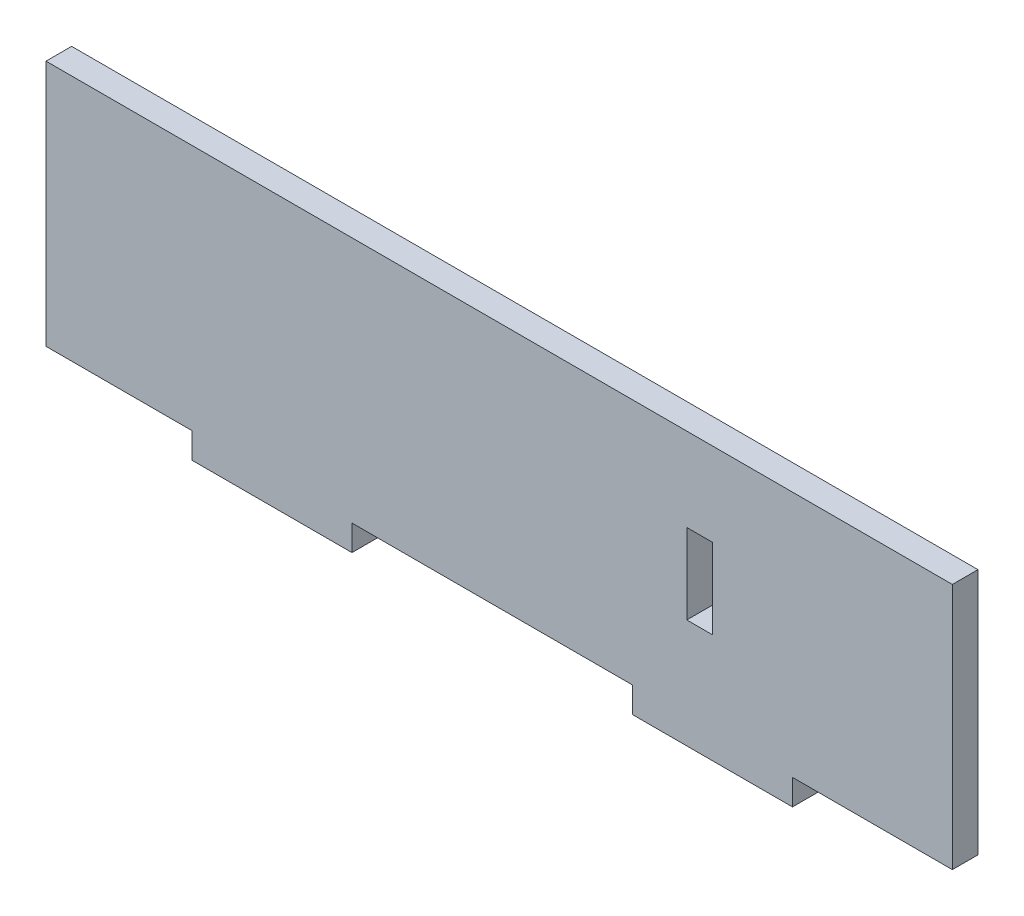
from build123d import *

# Parameters (mm, degrees)
SKETCH1_W           = 16
SKETCH1_H           = 50
BOSS_EXTRUDE1_DEPTH = 16


with BuildPart() as part:
    # Sketch1 → Boss-Extrude1 (new body)
    with BuildSketch(Plane.XY):
        Polygon((9, 3.385696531), (100, 3.385696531), (100, -12.614303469), (200, -12.614303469), (200, 3.385696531), (375, 3.385696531), (375, -12.614303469), (475, -12.614303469), (475, 3.385696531), (574.8, 3.385696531), (574.8, 157.585696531), (9, 157.585696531), align=None)
        with Locations((417, 80.485696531)):
            Rectangle(SKETCH1_W, SKETCH1_H, mode=Mode.SUBTRACT)
    extrude(amount=BOSS_EXTRUDE1_DEPTH)


solid = part.part
